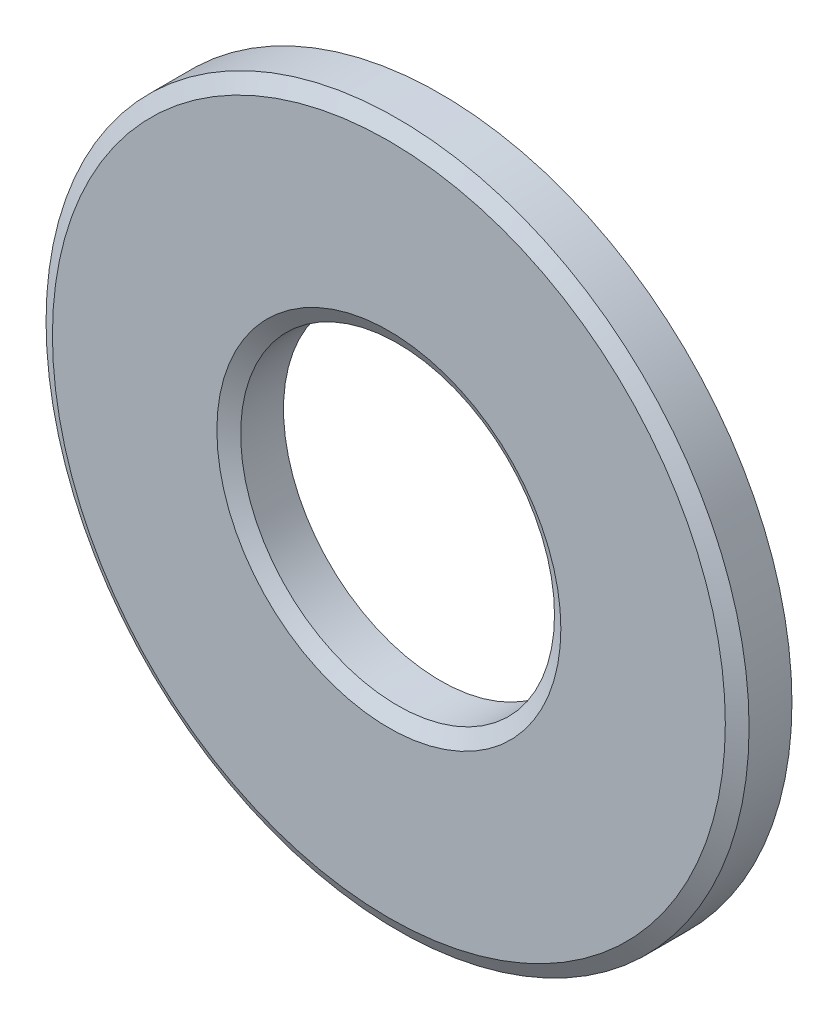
ISO-10303-21;
HEADER;
FILE_DESCRIPTION(('STEP AP214'),'2;1');
FILE_NAME('part.step','',(''),(''),'','','');
FILE_SCHEMA(('AUTOMOTIVE_DESIGN { 1 0 10303 214 1 1 1 1 }'));
ENDSEC;
DATA;
#1=APPLICATION_CONTEXT('core data for automotive mechanical design processes');
#2=APPLICATION_PROTOCOL_DEFINITION('international standard','automotive_design',2000,#1);
#3=PRODUCT_CONTEXT('',#1,'mechanical');
#4=PRODUCT('Part','Part','',(#3));
#5=PRODUCT_RELATED_PRODUCT_CATEGORY('part','',(#4));
#6=PRODUCT_DEFINITION_FORMATION('','',#4);
#7=PRODUCT_DEFINITION_CONTEXT('part definition',#1,'design');
#8=PRODUCT_DEFINITION('design','',#6,#7);
#9=PRODUCT_DEFINITION_SHAPE('','',#8);
#10=(LENGTH_UNIT() NAMED_UNIT(*) SI_UNIT(.MILLI.,.METRE.));
#11=(NAMED_UNIT(*) PLANE_ANGLE_UNIT() SI_UNIT($,.RADIAN.));
#12=(NAMED_UNIT(*) SI_UNIT($,.STERADIAN.) SOLID_ANGLE_UNIT());
#13=UNCERTAINTY_MEASURE_WITH_UNIT(LENGTH_MEASURE(1.E-05),#10,'distance_accuracy_value','');
#14=(GEOMETRIC_REPRESENTATION_CONTEXT(3) GLOBAL_UNCERTAINTY_ASSIGNED_CONTEXT((#13)) GLOBAL_UNIT_ASSIGNED_CONTEXT((#10,
#11,#12)) REPRESENTATION_CONTEXT('',''));
#15=CARTESIAN_POINT('',(0.,0.,0.));
#16=DIRECTION('',(0.,0.,1.));
#17=DIRECTION('',(1.,0.,0.));
#18=AXIS2_PLACEMENT_3D('',#15,#16,#17);
#19=CARTESIAN_POINT('',(0.,0.,1.2));
#20=DIRECTION('',(0.,0.,1.));
#21=DIRECTION('',(0.999999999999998,0.,0.));
#22=AXIS2_PLACEMENT_3D('',#19,#20,#21);
#23=PLANE('',#22);
#24=CARTESIAN_POINT('',(0.,0.,1.2));
#25=DIRECTION('',(0.,0.,1.));
#26=DIRECTION('',(0.999999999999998,0.,0.));
#27=AXIS2_PLACEMENT_3D('',#24,#25,#26);
#28=CIRCLE('',#27,3.425);
#29=CARTESIAN_POINT('',(3.425,0.,1.2));
#30=VERTEX_POINT('',#29);
#31=EDGE_CURVE('E50',#30,#30,#28,.F.);
#32=ORIENTED_EDGE('',*,*,#31,.T.);
#33=EDGE_LOOP('',(#32));
#34=FACE_BOUND('',#33,.T.);
#35=CARTESIAN_POINT('',(0.,0.,1.2));
#36=DIRECTION('',(0.,0.,1.));
#37=DIRECTION('',(0.999999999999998,0.,0.));
#38=AXIS2_PLACEMENT_3D('',#35,#36,#37);
#39=CIRCLE('',#38,6.7);
#40=CARTESIAN_POINT('',(6.69999999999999,0.,1.2));
#41=VERTEX_POINT('',#40);
#42=EDGE_CURVE('E53',#41,#41,#39,.T.);
#43=ORIENTED_EDGE('',*,*,#42,.T.);
#44=EDGE_LOOP('',(#43));
#45=FACE_BOUND('',#44,.T.);
#46=ADVANCED_FACE('F30',(#34,#45),#23,.T.);
#47=CARTESIAN_POINT('',(0.,0.,0.));
#48=DIRECTION('',(0.,0.,1.));
#49=DIRECTION('',(0.999999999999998,0.,0.));
#50=AXIS2_PLACEMENT_3D('',#47,#48,#49);
#51=PLANE('',#50);
#52=CARTESIAN_POINT('',(0.,0.,0.));
#53=DIRECTION('',(0.,0.,1.));
#54=DIRECTION('',(0.999999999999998,0.,0.));
#55=AXIS2_PLACEMENT_3D('',#52,#53,#54);
#56=CIRCLE('',#55,3.425);
#57=CARTESIAN_POINT('',(3.425,0.,0.));
#58=VERTEX_POINT('',#57);
#59=EDGE_CURVE('E41',#58,#58,#56,.T.);
#60=ORIENTED_EDGE('',*,*,#59,.T.);
#61=EDGE_LOOP('',(#60));
#62=FACE_BOUND('',#61,.T.);
#63=CARTESIAN_POINT('',(0.,0.,0.));
#64=DIRECTION('',(0.,0.,1.));
#65=DIRECTION('',(0.999999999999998,0.,0.));
#66=AXIS2_PLACEMENT_3D('',#63,#64,#65);
#67=CIRCLE('',#66,6.7);
#68=CARTESIAN_POINT('',(6.69999999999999,0.,0.));
#69=VERTEX_POINT('',#68);
#70=EDGE_CURVE('E45',#69,#69,#67,.F.);
#71=ORIENTED_EDGE('',*,*,#70,.T.);
#72=EDGE_LOOP('',(#71));
#73=FACE_BOUND('',#72,.T.);
#74=ADVANCED_FACE('F73',(#62,#73),#51,.F.);
#75=CARTESIAN_POINT('',(0.,0.,1.2));
#76=DIRECTION('',(0.,0.,-1.));
#77=DIRECTION('',(-0.999999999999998,0.,0.));
#78=AXIS2_PLACEMENT_3D('',#75,#76,#77);
#79=CYLINDRICAL_SURFACE('',#78,7.);
#80=CARTESIAN_POINT('',(0.,0.,1.02679491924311));
#81=DIRECTION('',(0.,0.,1.));
#82=DIRECTION('',(0.999999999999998,0.,0.));
#83=AXIS2_PLACEMENT_3D('',#80,#81,#82);
#84=CIRCLE('',#83,7.);
#85=CARTESIAN_POINT('',(6.99999999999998,0.,1.02679491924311));
#86=VERTEX_POINT('',#85);
#87=EDGE_CURVE('E10',#86,#86,#84,.F.);
#88=ORIENTED_EDGE('',*,*,#87,.T.);
#89=EDGE_LOOP('',(#88));
#90=FACE_BOUND('',#89,.T.);
#91=CARTESIAN_POINT('',(0.,0.,0.17320508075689));
#92=DIRECTION('',(0.,0.,1.));
#93=DIRECTION('',(0.999999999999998,0.,0.));
#94=AXIS2_PLACEMENT_3D('',#91,#92,#93);
#95=CIRCLE('',#94,7.);
#96=CARTESIAN_POINT('',(6.99999999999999,0.,0.17320508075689));
#97=VERTEX_POINT('',#96);
#98=EDGE_CURVE('E37',#97,#97,#95,.T.);
#99=ORIENTED_EDGE('',*,*,#98,.T.);
#100=EDGE_LOOP('',(#99));
#101=FACE_BOUND('',#100,.T.);
#102=ADVANCED_FACE('F32',(#90,#101),#79,.T.);
#103=CARTESIAN_POINT('',(0.,0.,1.2));
#104=DIRECTION('',(0.,0.,-1.));
#105=DIRECTION('',(-0.999999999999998,0.,0.));
#106=AXIS2_PLACEMENT_3D('',#103,#104,#105);
#107=CYLINDRICAL_SURFACE('',#106,3.125);
#108=CARTESIAN_POINT('',(0.,0.,1.02679491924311));
#109=DIRECTION('',(0.,0.,1.));
#110=DIRECTION('',(0.999999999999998,0.,0.));
#111=AXIS2_PLACEMENT_3D('',#108,#109,#110);
#112=CIRCLE('',#111,3.125);
#113=CARTESIAN_POINT('',(3.12499999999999,0.,1.02679491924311));
#114=VERTEX_POINT('',#113);
#115=EDGE_CURVE('E56',#114,#114,#112,.T.);
#116=ORIENTED_EDGE('',*,*,#115,.T.);
#117=EDGE_LOOP('',(#116));
#118=FACE_BOUND('',#117,.T.);
#119=CARTESIAN_POINT('',(0.,0.,0.17320508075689));
#120=DIRECTION('',(0.,0.,1.));
#121=DIRECTION('',(0.999999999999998,0.,0.));
#122=AXIS2_PLACEMENT_3D('',#119,#120,#121);
#123=CIRCLE('',#122,3.125);
#124=CARTESIAN_POINT('',(3.12499999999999,0.,0.17320508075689));
#125=VERTEX_POINT('',#124);
#126=EDGE_CURVE('E59',#125,#125,#123,.F.);
#127=ORIENTED_EDGE('',*,*,#126,.T.);
#128=EDGE_LOOP('',(#127));
#129=FACE_BOUND('',#128,.T.);
#130=ADVANCED_FACE('F63',(#118,#129),#107,.F.);
#131=CARTESIAN_POINT('',(0.,0.,1.02679491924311));
#132=DIRECTION('',(0.,0.,1.));
#133=DIRECTION('',(0.999999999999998,0.,0.));
#134=AXIS2_PLACEMENT_3D('',#131,#132,#133);
#135=CONICAL_SURFACE('',#134,3.125,1.0471975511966);
#136=ORIENTED_EDGE('',*,*,#31,.F.);
#137=EDGE_LOOP('',(#136));
#138=FACE_BOUND('',#137,.T.);
#139=ORIENTED_EDGE('',*,*,#115,.F.);
#140=EDGE_LOOP('',(#139));
#141=FACE_BOUND('',#140,.T.);
#142=ADVANCED_FACE('F69',(#138,#141),#135,.F.);
#143=CARTESIAN_POINT('',(0.,0.,0.));
#144=DIRECTION('',(0.,0.,-1.));
#145=DIRECTION('',(-0.999999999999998,0.,0.));
#146=AXIS2_PLACEMENT_3D('',#143,#144,#145);
#147=CONICAL_SURFACE('',#146,3.425,1.0471975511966);
#148=ORIENTED_EDGE('',*,*,#126,.F.);
#149=EDGE_LOOP('',(#148));
#150=FACE_BOUND('',#149,.T.);
#151=ORIENTED_EDGE('',*,*,#59,.F.);
#152=EDGE_LOOP('',(#151));
#153=FACE_BOUND('',#152,.T.);
#154=ADVANCED_FACE('F65',(#150,#153),#147,.F.);
#155=CARTESIAN_POINT('',(0.,0.,1.2));
#156=DIRECTION('',(0.,0.,-1.));
#157=DIRECTION('',(-0.999999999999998,0.,0.));
#158=AXIS2_PLACEMENT_3D('',#155,#156,#157);
#159=CONICAL_SURFACE('',#158,6.7,1.0471975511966);
#160=ORIENTED_EDGE('',*,*,#87,.F.);
#161=EDGE_LOOP('',(#160));
#162=FACE_BOUND('',#161,.T.);
#163=ORIENTED_EDGE('',*,*,#42,.F.);
#164=EDGE_LOOP('',(#163));
#165=FACE_BOUND('',#164,.T.);
#166=ADVANCED_FACE('F68',(#162,#165),#159,.T.);
#167=CARTESIAN_POINT('',(0.,0.,0.17320508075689));
#168=DIRECTION('',(0.,0.,1.));
#169=DIRECTION('',(0.999999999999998,0.,0.));
#170=AXIS2_PLACEMENT_3D('',#167,#168,#169);
#171=CONICAL_SURFACE('',#170,7.,1.0471975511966);
#172=ORIENTED_EDGE('',*,*,#70,.F.);
#173=EDGE_LOOP('',(#172));
#174=FACE_BOUND('',#173,.T.);
#175=ORIENTED_EDGE('',*,*,#98,.F.);
#176=EDGE_LOOP('',(#175));
#177=FACE_BOUND('',#176,.T.);
#178=ADVANCED_FACE('F79',(#174,#177),#171,.T.);
#179=CLOSED_SHELL('',(#46,#74,#102,#130,#142,#154,#166,#178));
#180=MANIFOLD_SOLID_BREP('B2',#179);
#181=ADVANCED_BREP_SHAPE_REPRESENTATION('',(#18,#180),#14);
#182=SHAPE_DEFINITION_REPRESENTATION(#9,#181);
ENDSEC;
END-ISO-10303-21;
